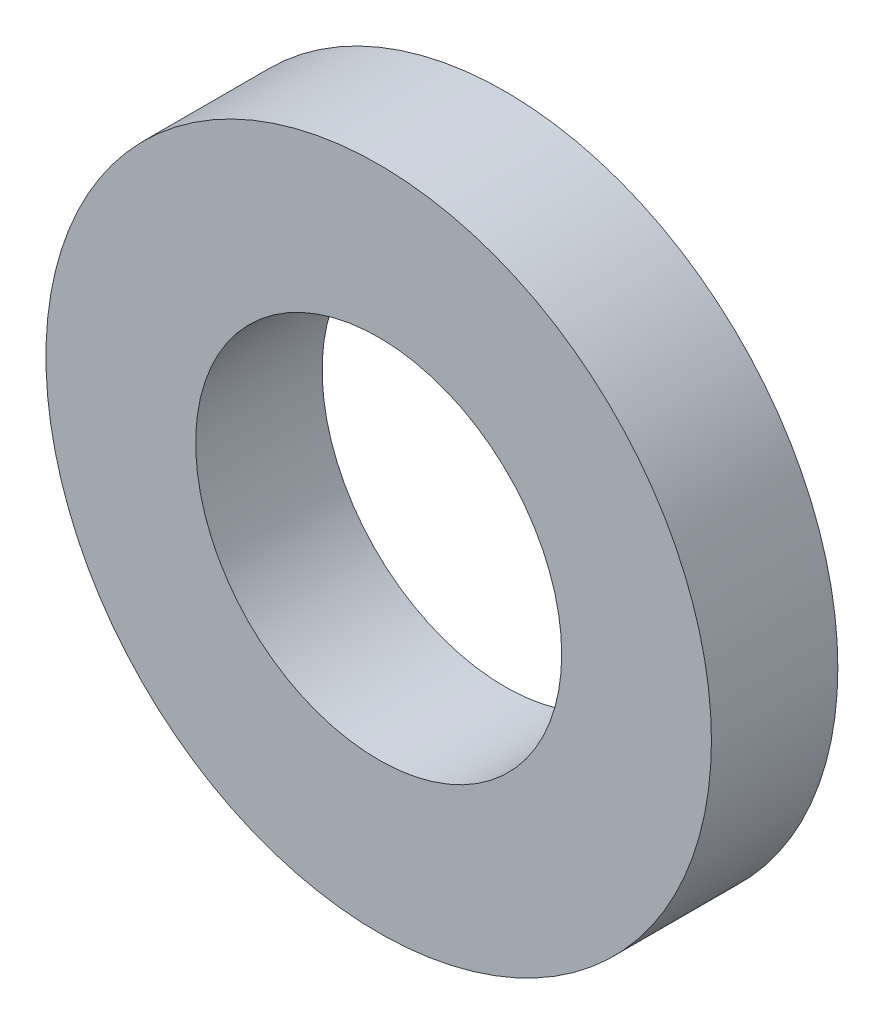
ISO-10303-21;
HEADER;
FILE_DESCRIPTION(('STEP AP214'),'2;1');
FILE_NAME('part.step','',(''),(''),'','','');
FILE_SCHEMA(('AUTOMOTIVE_DESIGN { 1 0 10303 214 1 1 1 1 }'));
ENDSEC;
DATA;
#1=APPLICATION_CONTEXT('core data for automotive mechanical design processes');
#2=APPLICATION_PROTOCOL_DEFINITION('international standard','automotive_design',2000,#1);
#3=PRODUCT_CONTEXT('',#1,'mechanical');
#4=PRODUCT('Part','Part','',(#3));
#5=PRODUCT_RELATED_PRODUCT_CATEGORY('part','',(#4));
#6=PRODUCT_DEFINITION_FORMATION('','',#4);
#7=PRODUCT_DEFINITION_CONTEXT('part definition',#1,'design');
#8=PRODUCT_DEFINITION('design','',#6,#7);
#9=PRODUCT_DEFINITION_SHAPE('','',#8);
#10=(LENGTH_UNIT() NAMED_UNIT(*) SI_UNIT(.MILLI.,.METRE.));
#11=(NAMED_UNIT(*) PLANE_ANGLE_UNIT() SI_UNIT($,.RADIAN.));
#12=(NAMED_UNIT(*) SI_UNIT($,.STERADIAN.) SOLID_ANGLE_UNIT());
#13=UNCERTAINTY_MEASURE_WITH_UNIT(LENGTH_MEASURE(1.E-05),#10,'distance_accuracy_value','');
#14=(GEOMETRIC_REPRESENTATION_CONTEXT(3) GLOBAL_UNCERTAINTY_ASSIGNED_CONTEXT((#13)) GLOBAL_UNIT_ASSIGNED_CONTEXT((#10,
#11,#12)) REPRESENTATION_CONTEXT('',''));
#15=CARTESIAN_POINT('',(0.,0.,0.));
#16=DIRECTION('',(0.,0.,1.));
#17=DIRECTION('',(1.,0.,0.));
#18=AXIS2_PLACEMENT_3D('',#15,#16,#17);
#19=CARTESIAN_POINT('',(0.,0.,0.));
#20=DIRECTION('',(0.,0.,1.));
#21=DIRECTION('',(1.,0.,0.));
#22=AXIS2_PLACEMENT_3D('',#19,#20,#21);
#23=CYLINDRICAL_SURFACE('',#22,55.);
#24=CARTESIAN_POINT('',(0.,0.,0.));
#25=DIRECTION('',(0.,0.,-1.));
#26=DIRECTION('',(-1.,0.,0.));
#27=AXIS2_PLACEMENT_3D('',#24,#25,#26);
#28=CIRCLE('',#27,55.);
#29=CARTESIAN_POINT('',(55.,0.,0.));
#30=VERTEX_POINT('',#29);
#31=EDGE_CURVE('E9',#30,#30,#28,.T.);
#32=ORIENTED_EDGE('',*,*,#31,.T.);
#33=DIRECTION('',(0.,0.,1.));
#34=VECTOR('',#33,1.);
#35=CARTESIAN_POINT('',(55.,0.,19.));
#36=LINE('',#35,#34);
#37=CARTESIAN_POINT('',(55.,0.,38.));
#38=VERTEX_POINT('',#37);
#39=EDGE_CURVE('E23',#30,#38,#36,.T.);
#40=ORIENTED_EDGE('',*,*,#39,.T.);
#41=CARTESIAN_POINT('',(0.,0.,38.));
#42=DIRECTION('',(0.,0.,1.));
#43=DIRECTION('',(1.,0.,0.));
#44=AXIS2_PLACEMENT_3D('',#41,#42,#43);
#45=CIRCLE('',#44,55.);
#46=EDGE_CURVE('E35',#38,#38,#45,.T.);
#47=ORIENTED_EDGE('',*,*,#46,.T.);
#48=ORIENTED_EDGE('',*,*,#39,.F.);
#49=EDGE_LOOP('',(#32,#40,#47,#48));
#50=FACE_BOUND('',#49,.T.);
#51=ADVANCED_FACE('F14',(#50),#23,.F.);
#52=CARTESIAN_POINT('',(0.,0.,0.));
#53=DIRECTION('',(0.,0.,1.));
#54=DIRECTION('',(1.,0.,0.));
#55=AXIS2_PLACEMENT_3D('',#52,#53,#54);
#56=CYLINDRICAL_SURFACE('',#55,100.);
#57=CARTESIAN_POINT('',(0.,0.,0.));
#58=DIRECTION('',(0.,0.,1.));
#59=DIRECTION('',(1.,0.,0.));
#60=AXIS2_PLACEMENT_3D('',#57,#58,#59);
#61=CIRCLE('',#60,100.);
#62=CARTESIAN_POINT('',(100.,0.,0.));
#63=VERTEX_POINT('',#62);
#64=EDGE_CURVE('E46',#63,#63,#61,.T.);
#65=ORIENTED_EDGE('',*,*,#64,.T.);
#66=DIRECTION('',(0.,0.,-1.));
#67=VECTOR('',#66,1.);
#68=CARTESIAN_POINT('',(100.,0.,19.));
#69=LINE('',#68,#67);
#70=CARTESIAN_POINT('',(100.,0.,38.));
#71=VERTEX_POINT('',#70);
#72=EDGE_CURVE('E18',#71,#63,#69,.T.);
#73=ORIENTED_EDGE('',*,*,#72,.F.);
#74=CARTESIAN_POINT('',(1.14491749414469E-13,1.11597562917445E-13,38.));
#75=DIRECTION('',(0.,0.,-1.));
#76=DIRECTION('',(-1.,0.,0.));
#77=AXIS2_PLACEMENT_3D('',#74,#75,#76);
#78=CIRCLE('',#77,100.);
#79=EDGE_CURVE('E42',#71,#71,#78,.T.);
#80=ORIENTED_EDGE('',*,*,#79,.T.);
#81=ORIENTED_EDGE('',*,*,#72,.T.);
#82=EDGE_LOOP('',(#65,#73,#80,#81));
#83=FACE_BOUND('',#82,.T.);
#84=ADVANCED_FACE('F55',(#83),#56,.T.);
#85=CARTESIAN_POINT('',(104.999996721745,-104.999996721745,38.));
#86=DIRECTION('',(0.,0.,1.));
#87=DIRECTION('',(0.,1.,0.));
#88=AXIS2_PLACEMENT_3D('',#85,#86,#87);
#89=PLANE('',#88);
#90=ORIENTED_EDGE('',*,*,#46,.F.);
#91=EDGE_LOOP('',(#90));
#92=FACE_BOUND('',#91,.T.);
#93=ORIENTED_EDGE('',*,*,#79,.F.);
#94=EDGE_LOOP('',(#93));
#95=FACE_BOUND('',#94,.T.);
#96=ADVANCED_FACE('F43',(#92,#95),#89,.T.);
#97=CARTESIAN_POINT('',(-104.999996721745,104.999996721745,0.));
#98=DIRECTION('',(0.,0.,-1.));
#99=DIRECTION('',(1.,0.,0.));
#100=AXIS2_PLACEMENT_3D('',#97,#98,#99);
#101=PLANE('',#100);
#102=ORIENTED_EDGE('',*,*,#31,.F.);
#103=EDGE_LOOP('',(#102));
#104=FACE_BOUND('',#103,.T.);
#105=ORIENTED_EDGE('',*,*,#64,.F.);
#106=EDGE_LOOP('',(#105));
#107=FACE_BOUND('',#106,.T.);
#108=ADVANCED_FACE('F16',(#104,#107),#101,.T.);
#109=CLOSED_SHELL('',(#51,#84,#96,#108));
#110=MANIFOLD_SOLID_BREP('B1',#109);
#111=ADVANCED_BREP_SHAPE_REPRESENTATION('',(#18,#110),#14);
#112=SHAPE_DEFINITION_REPRESENTATION(#9,#111);
ENDSEC;
END-ISO-10303-21;
